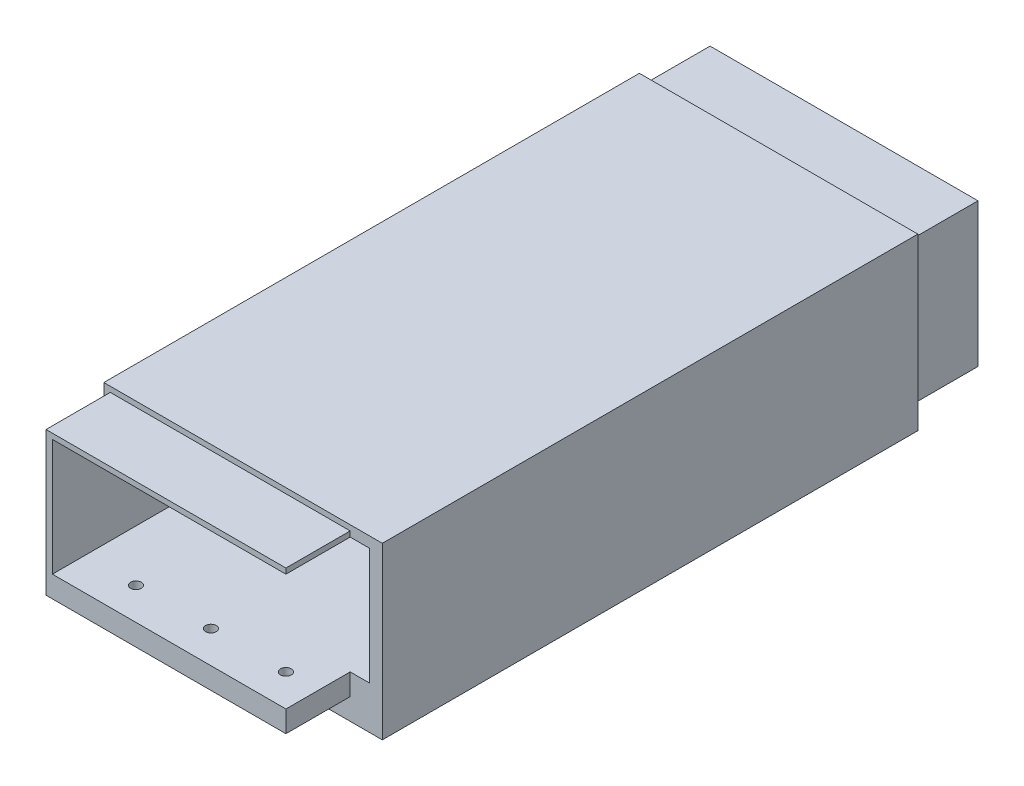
from build123d import *

# Parameters (mm, degrees)
SKETCH_1_W          = 125.075330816
SKETCH_1_H          = 66.992730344
SKETCH_1_W_2        = 118
SKETCH_1_H_2        = 54.492730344
EXTRUDE_1_DEPTH     = 30
SKETCH_2_W          = 130
SKETCH_2_H          = 79.492730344
EXTRUDE_2_DEPTH     = 250
CUT_EXTRUDE_1_REACH = 314.68
SKETCH_3_W          = 118
SKETCH_3_H          = 54.492730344
SKETCH_4_W          = 124
SKETCH_4_H          = 66.992730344
SKETCH_4_W_2        = 118
SKETCH_4_H_2        = 54.492730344
EXTRUDE_3_DEPTH     = 30
CUT_EXTRUDE_2_REACH = 1707.81
SKETCH_5_R          = 2.5
CUT_EXTRUDE_3_REACH = 1707.81
SKETCH_6_R          = 2.5
SKETCH_9_W          = 40
SKETCH_9_H          = 79.492730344
CUT_EXTRUDE_6_DEPTH = 15


with BuildPart() as part:
    # Sketch 1 → Extrude 1 (new body)
    with BuildSketch(Plane.XY.offset(1390)):
        with Locations((-56.764728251, 106.521030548)):
            Rectangle(SKETCH_1_W, SKETCH_1_H)
        with Locations((-57.302393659, 110.271030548)):
            Rectangle(SKETCH_1_W_2, SKETCH_1_H_2, mode=Mode.SUBTRACT)
    extrude(amount=EXTRUDE_1_DEPTH)

    # Sketch 2 → Extrude 2 (add)
    with BuildSketch(Plane.XY.offset(1420)):
        with Locations((-57.302393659, 102.771030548)):
            Rectangle(SKETCH_2_W, SKETCH_2_H)
    extrude(amount=EXTRUDE_2_DEPTH)

    # Sketch 3 → Cut-Extrude 1 (cut, up to next)
    with BuildSketch(Plane(origin=(0, 0, 1420), x_dir=(-1, 0, 0), z_dir=(0, 0, -1)), mode=Mode.PRIVATE) as cut_extrude_1_sk1:
        with Locations((57.302393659, 110.271030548)):
            Rectangle(SKETCH_3_W, SKETCH_3_H)
    cut_extrude_1_tool1 = extrude(cut_extrude_1_sk1.sketch, amount=-CUT_EXTRUDE_1_REACH, mode=Mode.PRIVATE) & part.part
    add(cut_extrude_1_tool1.solids().sort_by_distance((-57.302394, 110.271031, 1420))[0], mode=Mode.SUBTRACT)

    # Sketch 4 → Extrude 3 (add)
    with BuildSketch(Plane.XY.offset(1670)):
        with Locations((-57.302393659, 106.521030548)):
            Rectangle(SKETCH_4_W, SKETCH_4_H)
        with Locations((-57.302393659, 110.271030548)):
            Rectangle(SKETCH_4_W_2, SKETCH_4_H_2, mode=Mode.SUBTRACT)
    extrude(amount=EXTRUDE_3_DEPTH)

    # Sketch 5 → Cut-Extrude 2 (cut, up to next)
    with BuildSketch(Plane.XZ.offset(-73.024665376), mode=Mode.PRIVATE) as cut_extrude_2_sk1:
        with Locations(Location((-92.302393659, 1405, 0), (0, 0, 270))):
            Circle(SKETCH_5_R)
    cut_extrude_2_tool1 = extrude(cut_extrude_2_sk1.sketch, amount=-CUT_EXTRUDE_2_REACH, mode=Mode.PRIVATE) & part.part
    # Sketch 5 → Cut-Extrude 2 (cut, up to next)
    with BuildSketch(Plane.XZ.offset(-73.024665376), mode=Mode.PRIVATE) as cut_extrude_2_sk2:
        with Locations(Location((-57.302393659, 1405, 0), (0, 0, 270))):
            Circle(SKETCH_5_R)
    cut_extrude_2_tool2 = extrude(cut_extrude_2_sk2.sketch, amount=-CUT_EXTRUDE_2_REACH, mode=Mode.PRIVATE) & part.part
    # Sketch 5 → Cut-Extrude 2 (cut, up to next)
    with BuildSketch(Plane.XZ.offset(-73.024665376), mode=Mode.PRIVATE) as cut_extrude_2_sk3:
        with Locations(Location((-22.302393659, 1405, 0), (0, 0, 270))):
            Circle(SKETCH_5_R)
    cut_extrude_2_tool3 = extrude(cut_extrude_2_sk3.sketch, amount=-CUT_EXTRUDE_2_REACH, mode=Mode.PRIVATE) & part.part
    add(cut_extrude_2_tool1.solids().sort_by_distance((-92.302394, 73.024665, 1405))[0], mode=Mode.SUBTRACT)
    add(cut_extrude_2_tool2.solids().sort_by_distance((-57.302394, 73.024665, 1405))[0], mode=Mode.SUBTRACT)
    add(cut_extrude_2_tool3.solids().sort_by_distance((-22.302394, 73.024665, 1405))[0], mode=Mode.SUBTRACT)

    # Sketch 6 → Cut-Extrude 3 (cut, up to next)
    with BuildSketch(Plane.XZ.offset(-73.024665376), mode=Mode.PRIVATE) as cut_extrude_3_sk1:
        with Locations(Location((-92.302393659, 1685, 0), (0, 0, 270))):
            Circle(SKETCH_6_R)
    cut_extrude_3_tool1 = extrude(cut_extrude_3_sk1.sketch, amount=-CUT_EXTRUDE_3_REACH, mode=Mode.PRIVATE) & part.part
    # Sketch 6 → Cut-Extrude 3 (cut, up to next)
    with BuildSketch(Plane.XZ.offset(-73.024665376), mode=Mode.PRIVATE) as cut_extrude_3_sk2:
        with Locations(Location((-57.302393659, 1685, 0), (0, 0, 270))):
            Circle(SKETCH_6_R)
    cut_extrude_3_tool2 = extrude(cut_extrude_3_sk2.sketch, amount=-CUT_EXTRUDE_3_REACH, mode=Mode.PRIVATE) & part.part
    # Sketch 6 → Cut-Extrude 3 (cut, up to next)
    with BuildSketch(Plane.XZ.offset(-73.024665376), mode=Mode.PRIVATE) as cut_extrude_3_sk3:
        with Locations(Location((-22.302393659, 1685, 0), (0, 0, 270))):
            Circle(SKETCH_6_R)
    cut_extrude_3_tool3 = extrude(cut_extrude_3_sk3.sketch, amount=-CUT_EXTRUDE_3_REACH, mode=Mode.PRIVATE) & part.part
    add(cut_extrude_3_tool1.solids().sort_by_distance((-92.302394, 73.024665, 1685))[0], mode=Mode.SUBTRACT)
    add(cut_extrude_3_tool2.solids().sort_by_distance((-57.302394, 73.024665, 1685))[0], mode=Mode.SUBTRACT)
    add(cut_extrude_3_tool3.solids().sort_by_distance((-22.302394, 73.024665, 1685))[0], mode=Mode.SUBTRACT)

    # Sketch 9 → Cut-Extrude 6 (cut)
    with BuildSketch(Plane(origin=(7.697606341, 0, 0), x_dir=(0, 0, -1), z_dir=(1, 0, 0))):
        with Locations((-1690, 102.771030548)):
            Rectangle(SKETCH_9_W, SKETCH_9_H)
    extrude(amount=-CUT_EXTRUDE_6_DEPTH, mode=Mode.SUBTRACT)


solid = part.part
